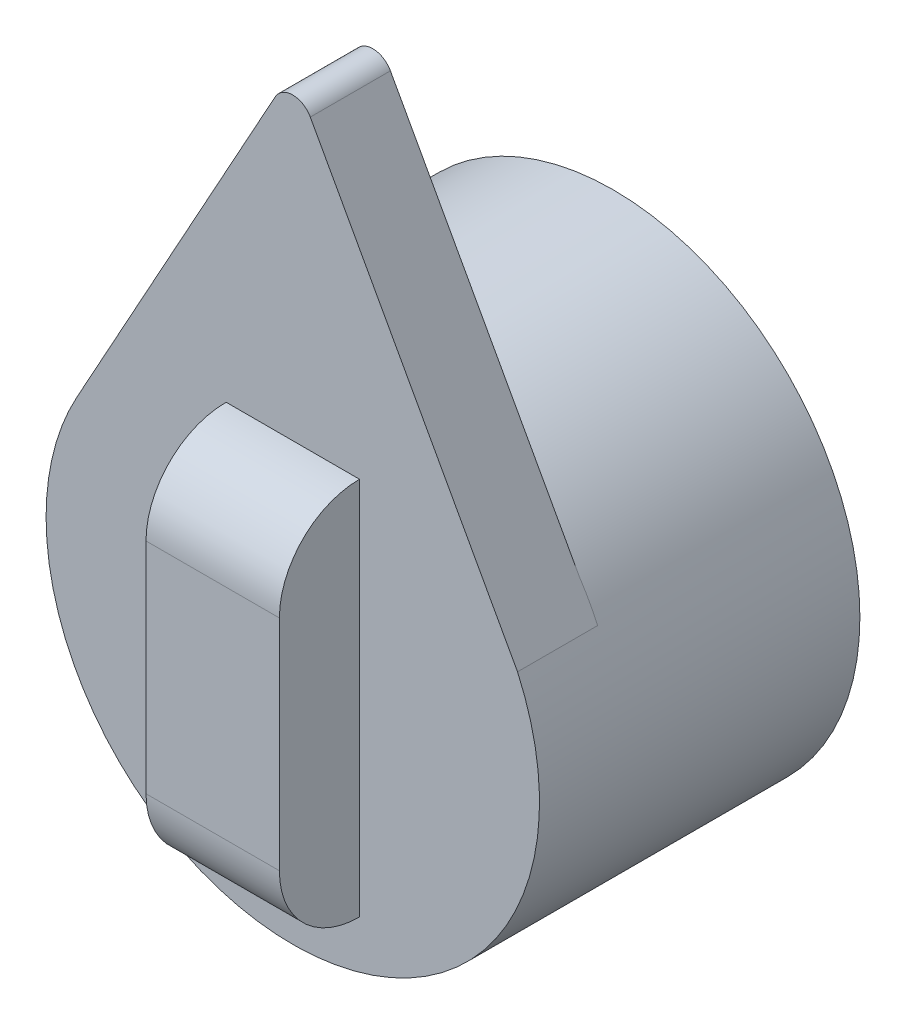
ISO-10303-21;
HEADER;
FILE_DESCRIPTION(('STEP AP214'),'2;1');
FILE_NAME('part.step','',(''),(''),'','','');
FILE_SCHEMA(('AUTOMOTIVE_DESIGN { 1 0 10303 214 1 1 1 1 }'));
ENDSEC;
DATA;
#1=APPLICATION_CONTEXT('core data for automotive mechanical design processes');
#2=APPLICATION_PROTOCOL_DEFINITION('international standard','automotive_design',2000,#1);
#3=PRODUCT_CONTEXT('',#1,'mechanical');
#4=PRODUCT('Part','Part','',(#3));
#5=PRODUCT_RELATED_PRODUCT_CATEGORY('part','',(#4));
#6=PRODUCT_DEFINITION_FORMATION('','',#4);
#7=PRODUCT_DEFINITION_CONTEXT('part definition',#1,'design');
#8=PRODUCT_DEFINITION('design','',#6,#7);
#9=PRODUCT_DEFINITION_SHAPE('','',#8);
#10=(LENGTH_UNIT() NAMED_UNIT(*) SI_UNIT(.MILLI.,.METRE.));
#11=(NAMED_UNIT(*) PLANE_ANGLE_UNIT() SI_UNIT($,.RADIAN.));
#12=(NAMED_UNIT(*) SI_UNIT($,.STERADIAN.) SOLID_ANGLE_UNIT());
#13=UNCERTAINTY_MEASURE_WITH_UNIT(LENGTH_MEASURE(1.E-05),#10,'distance_accuracy_value','');
#14=(GEOMETRIC_REPRESENTATION_CONTEXT(3) GLOBAL_UNCERTAINTY_ASSIGNED_CONTEXT((#13)) GLOBAL_UNIT_ASSIGNED_CONTEXT((#10,
#11,#12)) REPRESENTATION_CONTEXT('',''));
#15=CARTESIAN_POINT('',(0.,0.,0.));
#16=DIRECTION('',(0.,0.,1.));
#17=DIRECTION('',(1.,0.,0.));
#18=AXIS2_PLACEMENT_3D('',#15,#16,#17);
#19=CARTESIAN_POINT('',(0.,0.,5.08));
#20=DIRECTION('',(0.,0.,-1.));
#21=DIRECTION('',(-1.,0.,0.));
#22=AXIS2_PLACEMENT_3D('',#19,#20,#21);
#23=PLANE('',#22);
#24=DIRECTION('',(1.,0.,0.));
#25=VECTOR('',#24,1.);
#26=CARTESIAN_POINT('',(0.,-3.47095970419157,5.08));
#27=LINE('',#26,#25);
#28=CARTESIAN_POINT('',(2.11474974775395,-3.47095970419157,5.08));
#29=VERTEX_POINT('',#28);
#30=CARTESIAN_POINT('',(-2.11474974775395,-3.47095970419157,5.08));
#31=VERTEX_POINT('',#30);
#32=EDGE_CURVE('E92',#29,#31,#27,.F.);
#33=ORIENTED_EDGE('',*,*,#32,.F.);
#34=DIRECTION('',(0.,1.,0.));
#35=VECTOR('',#34,1.);
#36=CARTESIAN_POINT('',(2.11474974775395,-6.01095970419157,5.08));
#37=LINE('',#36,#35);
#38=CARTESIAN_POINT('',(2.11474974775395,3.47095970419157,5.08));
#39=VERTEX_POINT('',#38);
#40=EDGE_CURVE('E90',#29,#39,#37,.T.);
#41=ORIENTED_EDGE('',*,*,#40,.T.);
#42=DIRECTION('',(-1.,0.,0.));
#43=VECTOR('',#42,1.);
#44=CARTESIAN_POINT('',(0.,3.47095970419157,5.08));
#45=LINE('',#44,#43);
#46=CARTESIAN_POINT('',(-2.11474974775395,3.47095970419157,5.08));
#47=VERTEX_POINT('',#46);
#48=EDGE_CURVE('E79',#47,#39,#45,.F.);
#49=ORIENTED_EDGE('',*,*,#48,.F.);
#50=DIRECTION('',(0.,1.,0.));
#51=VECTOR('',#50,1.);
#52=CARTESIAN_POINT('',(-2.11474974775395,-6.01095970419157,5.08));
#53=LINE('',#52,#51);
#54=EDGE_CURVE('E144',#47,#31,#53,.F.);
#55=ORIENTED_EDGE('',*,*,#54,.T.);
#56=EDGE_LOOP('',(#33,#41,#49,#55));
#57=FACE_BOUND('',#56,.T.);
#58=ADVANCED_FACE('F16',(#57),#23,.F.);
#59=CARTESIAN_POINT('',(-0.001088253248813,14.8704751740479,2.54));
#60=DIRECTION('',(0.,0.,-1.));
#61=DIRECTION('',(-1.,0.,0.));
#62=AXIS2_PLACEMENT_3D('',#59,#60,#61);
#63=CYLINDRICAL_SURFACE('',#62,0.635);
#64=CARTESIAN_POINT('',(-0.001088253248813,14.8704751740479,2.54));
#65=DIRECTION('',(0.,0.,-1.));
#66=DIRECTION('',(-1.,0.,0.));
#67=AXIS2_PLACEMENT_3D('',#64,#65,#66);
#68=CIRCLE('',#67,0.635);
#69=CARTESIAN_POINT('',(0.555324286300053,15.1764655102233,2.54));
#70=VERTEX_POINT('',#69);
#71=CARTESIAN_POINT('',(-0.55699388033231,15.1773854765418,2.54));
#72=VERTEX_POINT('',#71);
#73=EDGE_CURVE('E115',#70,#72,#68,.F.);
#74=ORIENTED_EDGE('',*,*,#73,.F.);
#75=DIRECTION('',(0.,0.,1.));
#76=VECTOR('',#75,1.);
#77=CARTESIAN_POINT('',(0.555324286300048,15.1764655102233,2.54));
#78=LINE('',#77,#76);
#79=CARTESIAN_POINT('',(0.555324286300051,15.1764655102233,0.));
#80=VERTEX_POINT('',#79);
#81=EDGE_CURVE('E125',#80,#70,#78,.T.);
#82=ORIENTED_EDGE('',*,*,#81,.F.);
#83=CARTESIAN_POINT('',(-0.001088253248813,14.8704751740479,0.));
#84=DIRECTION('',(0.,0.,-1.));
#85=DIRECTION('',(-1.,0.,0.));
#86=AXIS2_PLACEMENT_3D('',#83,#84,#85);
#87=CIRCLE('',#86,0.635);
#88=CARTESIAN_POINT('',(-0.55699388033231,15.1773854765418,0.));
#89=VERTEX_POINT('',#88);
#90=EDGE_CURVE('E123',#80,#89,#87,.F.);
#91=ORIENTED_EDGE('',*,*,#90,.T.);
#92=DIRECTION('',(0.,0.,1.));
#93=VECTOR('',#92,1.);
#94=CARTESIAN_POINT('',(-0.556993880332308,15.1773854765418,2.54));
#95=LINE('',#94,#93);
#96=EDGE_CURVE('E120',#72,#89,#95,.F.);
#97=ORIENTED_EDGE('',*,*,#96,.F.);
#98=EDGE_LOOP('',(#74,#82,#91,#97));
#99=FACE_BOUND('',#98,.T.);
#100=ADVANCED_FACE('F189',(#99),#63,.T.);
#101=CARTESIAN_POINT('',(0.,3.47095970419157,2.54));
#102=DIRECTION('',(-1.,0.,0.));
#103=DIRECTION('',(0.,0.,1.));
#104=AXIS2_PLACEMENT_3D('',#101,#102,#103);
#105=CYLINDRICAL_SURFACE('',#104,2.54);
#106=CARTESIAN_POINT('',(-2.11474974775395,3.47095970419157,2.54));
#107=DIRECTION('',(-1.,0.,0.));
#108=DIRECTION('',(0.,0.,1.));
#109=AXIS2_PLACEMENT_3D('',#106,#107,#108);
#110=CIRCLE('',#109,2.54);
#111=CARTESIAN_POINT('',(-2.11474974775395,6.01095970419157,2.54));
#112=VERTEX_POINT('',#111);
#113=EDGE_CURVE('E85',#112,#47,#110,.F.);
#114=ORIENTED_EDGE('',*,*,#113,.T.);
#115=ORIENTED_EDGE('',*,*,#48,.T.);
#116=CARTESIAN_POINT('',(2.11474974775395,3.47095970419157,2.54));
#117=DIRECTION('',(-1.,0.,0.));
#118=DIRECTION('',(0.,0.,1.));
#119=AXIS2_PLACEMENT_3D('',#116,#117,#118);
#120=CIRCLE('',#119,2.54);
#121=CARTESIAN_POINT('',(2.11474974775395,6.01095970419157,2.54));
#122=VERTEX_POINT('',#121);
#123=EDGE_CURVE('E19',#39,#122,#120,.T.);
#124=ORIENTED_EDGE('',*,*,#123,.T.);
#125=DIRECTION('',(1.,0.,0.));
#126=VECTOR('',#125,1.);
#127=CARTESIAN_POINT('',(0.,6.01095970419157,2.54));
#128=LINE('',#127,#126);
#129=EDGE_CURVE('E105',#112,#122,#128,.T.);
#130=ORIENTED_EDGE('',*,*,#129,.F.);
#131=EDGE_LOOP('',(#114,#115,#124,#130));
#132=FACE_BOUND('',#131,.T.);
#133=ADVANCED_FACE('F81',(#132),#105,.T.);
#134=CARTESIAN_POINT('',(2.11474974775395,-6.01095970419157,5.08));
#135=DIRECTION('',(-1.,0.,0.));
#136=DIRECTION('',(0.,0.,1.));
#137=AXIS2_PLACEMENT_3D('',#134,#135,#136);
#138=PLANE('',#137);
#139=CARTESIAN_POINT('',(2.11474974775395,-3.47095970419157,2.54));
#140=DIRECTION('',(1.,0.,0.));
#141=DIRECTION('',(0.,0.,-1.));
#142=AXIS2_PLACEMENT_3D('',#139,#140,#141);
#143=CIRCLE('',#142,2.54);
#144=CARTESIAN_POINT('',(2.11474974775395,-6.01095970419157,2.54));
#145=VERTEX_POINT('',#144);
#146=EDGE_CURVE('E95',#145,#29,#143,.F.);
#147=ORIENTED_EDGE('',*,*,#146,.F.);
#148=DIRECTION('',(0.,1.,0.));
#149=VECTOR('',#148,1.);
#150=CARTESIAN_POINT('',(2.11474974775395,0.,2.54));
#151=LINE('',#150,#149);
#152=EDGE_CURVE('E99',#122,#145,#151,.F.);
#153=ORIENTED_EDGE('',*,*,#152,.F.);
#154=ORIENTED_EDGE('',*,*,#123,.F.);
#155=ORIENTED_EDGE('',*,*,#40,.F.);
#156=EDGE_LOOP('',(#147,#153,#154,#155));
#157=FACE_BOUND('',#156,.T.);
#158=ADVANCED_FACE('F97',(#157),#138,.F.);
#159=CARTESIAN_POINT('',(0.,-3.47095970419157,2.54));
#160=DIRECTION('',(1.,0.,0.));
#161=DIRECTION('',(0.,0.,-1.));
#162=AXIS2_PLACEMENT_3D('',#159,#160,#161);
#163=CYLINDRICAL_SURFACE('',#162,2.54);
#164=ORIENTED_EDGE('',*,*,#146,.T.);
#165=ORIENTED_EDGE('',*,*,#32,.T.);
#166=CARTESIAN_POINT('',(-2.11474974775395,-3.47095970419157,2.54));
#167=DIRECTION('',(1.,0.,0.));
#168=DIRECTION('',(0.,0.,-1.));
#169=AXIS2_PLACEMENT_3D('',#166,#167,#168);
#170=CIRCLE('',#169,2.54);
#171=CARTESIAN_POINT('',(-2.11474974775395,-6.01095970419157,2.54));
#172=VERTEX_POINT('',#171);
#173=EDGE_CURVE('E124',#31,#172,#170,.T.);
#174=ORIENTED_EDGE('',*,*,#173,.T.);
#175=DIRECTION('',(1.,0.,0.));
#176=VECTOR('',#175,1.);
#177=CARTESIAN_POINT('',(0.,-6.01095970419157,2.54));
#178=LINE('',#177,#176);
#179=EDGE_CURVE('E104',#145,#172,#178,.F.);
#180=ORIENTED_EDGE('',*,*,#179,.F.);
#181=EDGE_LOOP('',(#164,#165,#174,#180));
#182=FACE_BOUND('',#181,.T.);
#183=ADVANCED_FACE('F146',(#182),#163,.T.);
#184=CARTESIAN_POINT('',(-2.11474974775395,-6.01095970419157,5.08));
#185=DIRECTION('',(1.,0.,0.));
#186=DIRECTION('',(0.,0.,-1.));
#187=AXIS2_PLACEMENT_3D('',#184,#185,#186);
#188=PLANE('',#187);
#189=ORIENTED_EDGE('',*,*,#173,.F.);
#190=ORIENTED_EDGE('',*,*,#54,.F.);
#191=ORIENTED_EDGE('',*,*,#113,.F.);
#192=DIRECTION('',(0.,1.,0.));
#193=VECTOR('',#192,1.);
#194=CARTESIAN_POINT('',(-2.11474974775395,0.,2.54));
#195=LINE('',#194,#193);
#196=EDGE_CURVE('E111',#172,#112,#195,.T.);
#197=ORIENTED_EDGE('',*,*,#196,.F.);
#198=EDGE_LOOP('',(#189,#190,#191,#197));
#199=FACE_BOUND('',#198,.T.);
#200=ADVANCED_FACE('F179',(#199),#188,.F.);
#201=CARTESIAN_POINT('',(-6.84875732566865,3.78113492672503,2.54));
#202=DIRECTION('',(-0.875441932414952,0.48332331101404,0.));
#203=DIRECTION('',(-0.48332331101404,-0.875441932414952,0.));
#204=AXIS2_PLACEMENT_3D('',#201,#202,#203);
#205=PLANE('',#204);
#206=DIRECTION('',(-0.48332331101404,-0.875441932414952,0.));
#207=VECTOR('',#206,1.);
#208=CARTESIAN_POINT('',(-0.556993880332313,15.1773854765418,2.54));
#209=LINE('',#208,#207);
#210=CARTESIAN_POINT('',(-6.84875732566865,3.78113492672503,2.54));
#211=VERTEX_POINT('',#210);
#212=EDGE_CURVE('E112',#72,#211,#209,.T.);
#213=ORIENTED_EDGE('',*,*,#212,.F.);
#214=ORIENTED_EDGE('',*,*,#96,.T.);
#215=DIRECTION('',(-0.48332331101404,-0.875441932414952,0.));
#216=VECTOR('',#215,1.);
#217=CARTESIAN_POINT('',(-0.556993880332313,15.1773854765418,0.));
#218=LINE('',#217,#216);
#219=CARTESIAN_POINT('',(-6.84875732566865,3.78113492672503,0.));
#220=VERTEX_POINT('',#219);
#221=EDGE_CURVE('E142',#89,#220,#218,.T.);
#222=ORIENTED_EDGE('',*,*,#221,.T.);
#223=DIRECTION('',(0.,0.,-1.));
#224=VECTOR('',#223,1.);
#225=CARTESIAN_POINT('',(-6.84875732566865,3.78113492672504,2.54));
#226=LINE('',#225,#224);
#227=EDGE_CURVE('E136',#211,#220,#226,.T.);
#228=ORIENTED_EDGE('',*,*,#227,.F.);
#229=EDGE_LOOP('',(#213,#214,#222,#228));
#230=FACE_BOUND('',#229,.T.);
#231=ADVANCED_FACE('F175',(#230),#205,.T.);
#232=CARTESIAN_POINT('',(0.,0.,0.));
#233=DIRECTION('',(0.,0.,1.));
#234=DIRECTION('',(1.,0.,0.));
#235=AXIS2_PLACEMENT_3D('',#232,#233,#234);
#236=PLANE('',#235);
#237=ORIENTED_EDGE('',*,*,#221,.F.);
#238=ORIENTED_EDGE('',*,*,#90,.F.);
#239=DIRECTION('',(-0.481874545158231,0.876240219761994,0.));
#240=VECTOR('',#239,1.);
#241=CARTESIAN_POINT('',(6.83445455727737,3.75850093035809,0.));
#242=LINE('',#241,#240);
#243=CARTESIAN_POINT('',(6.54278711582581,4.2888687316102,0.));
#244=VERTEX_POINT('',#243);
#245=EDGE_CURVE('E127',#244,#80,#242,.T.);
#246=ORIENTED_EDGE('',*,*,#245,.F.);
#247=CARTESIAN_POINT('',(0.,0.,0.));
#248=DIRECTION('',(0.,0.,-1.));
#249=DIRECTION('',(-1.,0.,0.));
#250=AXIS2_PLACEMENT_3D('',#247,#248,#249);
#251=CIRCLE('',#250,7.8232);
#252=EDGE_CURVE('E132',#220,#244,#251,.T.);
#253=ORIENTED_EDGE('',*,*,#252,.F.);
#254=EDGE_LOOP('',(#237,#238,#246,#253));
#255=FACE_BOUND('',#254,.T.);
#256=ADVANCED_FACE('F171',(#255),#236,.F.);
#257=CARTESIAN_POINT('',(6.83445455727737,3.75850093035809,2.54));
#258=DIRECTION('',(0.876240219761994,0.481874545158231,0.));
#259=DIRECTION('',(-0.481874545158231,0.876240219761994,0.));
#260=AXIS2_PLACEMENT_3D('',#257,#258,#259);
#261=PLANE('',#260);
#262=DIRECTION('',(0.,0.,-1.));
#263=VECTOR('',#262,1.);
#264=CARTESIAN_POINT('',(7.12612199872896,3.22813312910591,2.54));
#265=LINE('',#264,#263);
#266=CARTESIAN_POINT('',(7.12612199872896,3.22813312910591,0.));
#267=VERTEX_POINT('',#266);
#268=CARTESIAN_POINT('',(7.12612199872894,3.22813312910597,2.54));
#269=VERTEX_POINT('',#268);
#270=EDGE_CURVE('E131',#267,#269,#265,.F.);
#271=ORIENTED_EDGE('',*,*,#270,.F.);
#272=CARTESIAN_POINT('',(0.,0.,0.));
#273=DIRECTION('',(0.,0.,-1.));
#274=DIRECTION('',(0.836331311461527,0.548224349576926,0.));
#275=AXIS2_PLACEMENT_3D('',#272,#273,#274);
#276=CIRCLE('',#275,7.8232);
#277=EDGE_CURVE('E135',#244,#267,#276,.T.);
#278=ORIENTED_EDGE('',*,*,#277,.F.);
#279=ORIENTED_EDGE('',*,*,#245,.T.);
#280=ORIENTED_EDGE('',*,*,#81,.T.);
#281=DIRECTION('',(-0.481874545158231,0.876240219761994,0.));
#282=VECTOR('',#281,1.);
#283=CARTESIAN_POINT('',(7.12612199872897,3.22813312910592,2.54));
#284=LINE('',#283,#282);
#285=EDGE_CURVE('E34',#269,#70,#284,.T.);
#286=ORIENTED_EDGE('',*,*,#285,.F.);
#287=EDGE_LOOP('',(#271,#278,#279,#280,#286));
#288=FACE_BOUND('',#287,.T.);
#289=ADVANCED_FACE('F161',(#288),#261,.T.);
#290=CARTESIAN_POINT('',(0.,0.,2.54));
#291=DIRECTION('',(0.,0.,1.));
#292=DIRECTION('',(1.,0.,0.));
#293=AXIS2_PLACEMENT_3D('',#290,#291,#292);
#294=PLANE('',#293);
#295=ORIENTED_EDGE('',*,*,#179,.T.);
#296=ORIENTED_EDGE('',*,*,#196,.T.);
#297=ORIENTED_EDGE('',*,*,#129,.T.);
#298=ORIENTED_EDGE('',*,*,#152,.T.);
#299=EDGE_LOOP('',(#295,#296,#297,#298));
#300=FACE_BOUND('',#299,.T.);
#301=ORIENTED_EDGE('',*,*,#212,.T.);
#302=CARTESIAN_POINT('',(0.,0.,2.54));
#303=DIRECTION('',(0.,0.,-1.));
#304=DIRECTION('',(-1.,0.,0.));
#305=AXIS2_PLACEMENT_3D('',#302,#303,#304);
#306=CIRCLE('',#305,7.8232);
#307=EDGE_CURVE('E25',#269,#211,#306,.T.);
#308=ORIENTED_EDGE('',*,*,#307,.F.);
#309=ORIENTED_EDGE('',*,*,#285,.T.);
#310=ORIENTED_EDGE('',*,*,#73,.T.);
#311=EDGE_LOOP('',(#301,#308,#309,#310));
#312=FACE_BOUND('',#311,.T.);
#313=ADVANCED_FACE('F108',(#300,#312),#294,.T.);
#314=CARTESIAN_POINT('',(0.,0.,-7.62));
#315=DIRECTION('',(0.,0.,-1.));
#316=DIRECTION('',(-1.,0.,0.));
#317=AXIS2_PLACEMENT_3D('',#314,#315,#316);
#318=PLANE('',#317);
#319=CARTESIAN_POINT('',(0.,0.,-7.62));
#320=DIRECTION('',(0.,0.,-1.));
#321=DIRECTION('',(-1.,0.,0.));
#322=AXIS2_PLACEMENT_3D('',#319,#320,#321);
#323=CIRCLE('',#322,7.8232);
#324=CARTESIAN_POINT('',(-7.8232,0.,-7.62));
#325=VERTEX_POINT('',#324);
#326=EDGE_CURVE('E11',#325,#325,#323,.F.);
#327=ORIENTED_EDGE('',*,*,#326,.F.);
#328=EDGE_LOOP('',(#327));
#329=FACE_BOUND('',#328,.T.);
#330=ADVANCED_FACE('F199',(#329),#318,.T.);
#331=CARTESIAN_POINT('',(0.,0.,2.54));
#332=DIRECTION('',(0.,0.,-1.));
#333=DIRECTION('',(-1.,0.,0.));
#334=AXIS2_PLACEMENT_3D('',#331,#332,#333);
#335=CYLINDRICAL_SURFACE('',#334,7.8232);
#336=ORIENTED_EDGE('',*,*,#326,.T.);
#337=EDGE_LOOP('',(#336));
#338=FACE_BOUND('',#337,.T.);
#339=ORIENTED_EDGE('',*,*,#270,.T.);
#340=ORIENTED_EDGE('',*,*,#307,.T.);
#341=ORIENTED_EDGE('',*,*,#227,.T.);
#342=ORIENTED_EDGE('',*,*,#252,.T.);
#343=ORIENTED_EDGE('',*,*,#277,.T.);
#344=EDGE_LOOP('',(#339,#340,#341,#342,#343));
#345=FACE_BOUND('',#344,.T.);
#346=ADVANCED_FACE('F197',(#338,#345),#335,.T.);
#347=CLOSED_SHELL('',(#58,#100,#133,#158,#183,#200,#231,#256,#289,#313,#330,#346));
#348=MANIFOLD_SOLID_BREP('B1',#347);
#349=ADVANCED_BREP_SHAPE_REPRESENTATION('',(#18,#348),#14);
#350=SHAPE_DEFINITION_REPRESENTATION(#9,#349);
ENDSEC;
END-ISO-10303-21;
